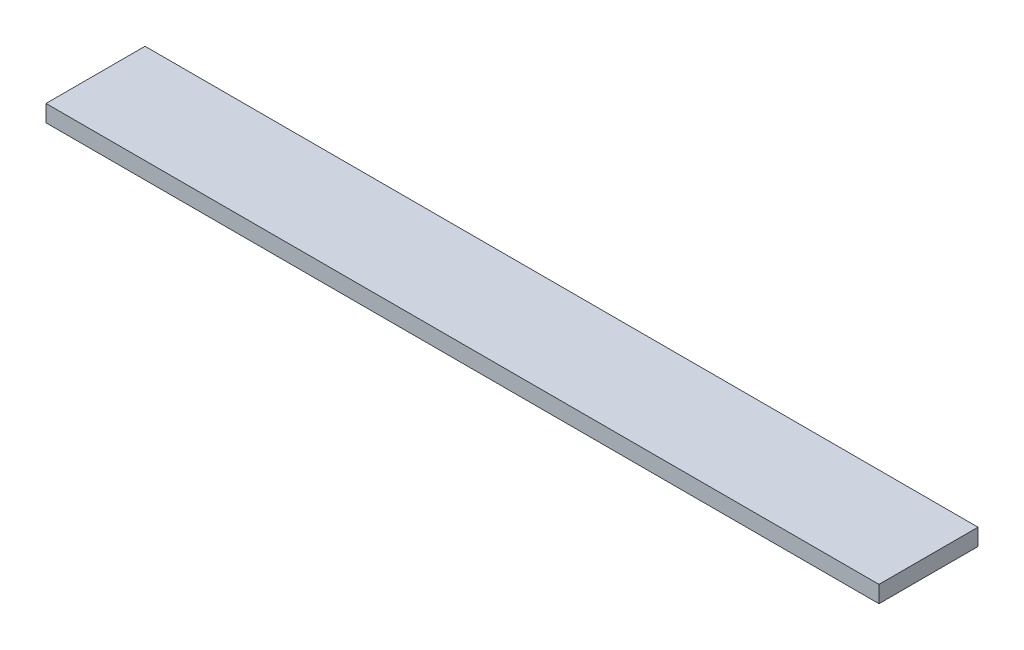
from build123d import *

# Parameters (mm, degrees)
SKETCH1_W      = 496.367737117
SKETCH1_H      = 59.014009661
EXTRUDE1_DEPTH = 10


with BuildPart() as part:
    # Sketch1 → Extrude1 (new body)
    with BuildSketch(Plane(origin=(0, 0, 0), x_dir=(1, 0, 0), z_dir=(0, 1, 0))):
        with Locations((125.172878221, -5.276086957)):
            Rectangle(SKETCH1_W, SKETCH1_H)
    extrude(amount=-EXTRUDE1_DEPTH)


solid = part.part
